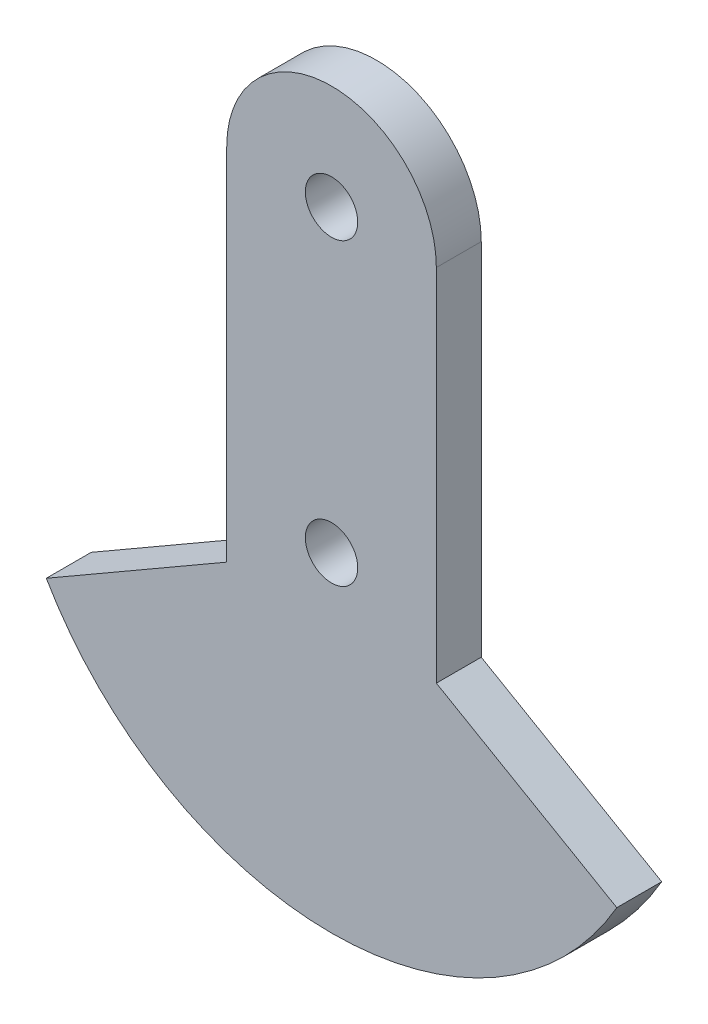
from build123d import *

# Parameters (mm, degrees)
SKETCH1_R      = 1.75
EXTRUDE1_DEPTH = 3


with BuildPart() as part:
    # Sketch1 → Extrude1 (new body)
    with BuildSketch(Plane.XY):
        with BuildLine():
            Line((7, 0), (7, -24.041451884))
            Line((7, -24.041451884), (19.052558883, -31))
            ThreePointArc((19.052558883, -31), (0, -42), (-19.052558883, -31))
            Line((-19.052558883, -31), (-7, -24.041451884))
            Line((-7, -24.041451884), (-7, 0))
            ThreePointArc((-7, 0), (0, 7), (7, 0))
        make_face()
        Circle(SKETCH1_R, mode=Mode.SUBTRACT)
        with Locations((0, -20)):
            Circle(SKETCH1_R, mode=Mode.SUBTRACT)
    extrude(amount=EXTRUDE1_DEPTH)


solid = part.part
